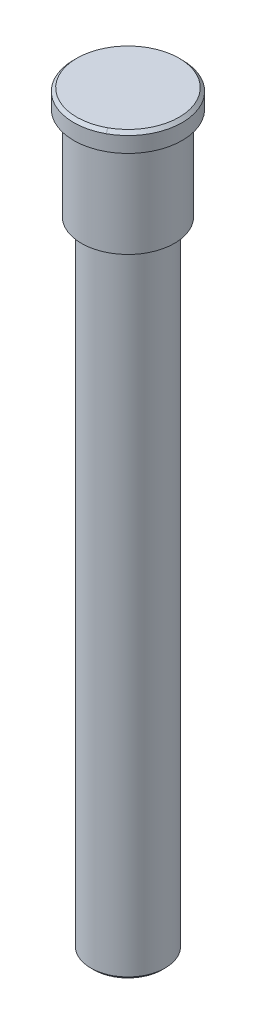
ISO-10303-21;
HEADER;
FILE_DESCRIPTION(('STEP AP214'),'2;1');
FILE_NAME('part.step','',(''),(''),'','','');
FILE_SCHEMA(('AUTOMOTIVE_DESIGN { 1 0 10303 214 1 1 1 1 }'));
ENDSEC;
DATA;
#1=APPLICATION_CONTEXT('core data for automotive mechanical design processes');
#2=APPLICATION_PROTOCOL_DEFINITION('international standard','automotive_design',2000,#1);
#3=PRODUCT_CONTEXT('',#1,'mechanical');
#4=PRODUCT('Part','Part','',(#3));
#5=PRODUCT_RELATED_PRODUCT_CATEGORY('part','',(#4));
#6=PRODUCT_DEFINITION_FORMATION('','',#4);
#7=PRODUCT_DEFINITION_CONTEXT('part definition',#1,'design');
#8=PRODUCT_DEFINITION('design','',#6,#7);
#9=PRODUCT_DEFINITION_SHAPE('','',#8);
#10=(LENGTH_UNIT() NAMED_UNIT(*) SI_UNIT(.MILLI.,.METRE.));
#11=(NAMED_UNIT(*) PLANE_ANGLE_UNIT() SI_UNIT($,.RADIAN.));
#12=(NAMED_UNIT(*) SI_UNIT($,.STERADIAN.) SOLID_ANGLE_UNIT());
#13=UNCERTAINTY_MEASURE_WITH_UNIT(LENGTH_MEASURE(1.E-05),#10,'distance_accuracy_value','');
#14=(GEOMETRIC_REPRESENTATION_CONTEXT(3) GLOBAL_UNCERTAINTY_ASSIGNED_CONTEXT((#13)) GLOBAL_UNIT_ASSIGNED_CONTEXT((#10,
#11,#12)) REPRESENTATION_CONTEXT('',''));
#15=CARTESIAN_POINT('',(0.,0.,0.));
#16=DIRECTION('',(0.,0.,1.));
#17=DIRECTION('',(1.,0.,0.));
#18=AXIS2_PLACEMENT_3D('',#15,#16,#17);
#19=CARTESIAN_POINT('',(0.,0.,0.));
#20=DIRECTION('',(0.,1.,0.));
#21=DIRECTION('',(0.,0.,1.));
#22=AXIS2_PLACEMENT_3D('',#19,#20,#21);
#23=PLANE('',#22);
#24=CARTESIAN_POINT('',(0.,-5.68156632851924E-11,0.));
#25=DIRECTION('',(0.,-1.,0.));
#26=DIRECTION('',(0.,0.,-1.));
#27=AXIS2_PLACEMENT_3D('',#24,#25,#26);
#28=CIRCLE('',#27,16.5000000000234);
#29=CARTESIAN_POINT('',(7.91052138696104,-2.8421709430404E-11,14.4801122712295));
#30=VERTEX_POINT('',#29);
#31=CARTESIAN_POINT('',(-7.91052085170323,-2.8421709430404E-11,-14.4801125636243));
#32=VERTEX_POINT('',#31);
#33=EDGE_CURVE('E28',#30,#32,#28,.T.);
#34=ORIENTED_EDGE('',*,*,#33,.F.);
#35=CARTESIAN_POINT('',(0.,0.,0.));
#36=DIRECTION('',(0.,-1.,0.));
#37=DIRECTION('',(0.,0.,-1.));
#38=AXIS2_PLACEMENT_3D('',#35,#36,#37);
#39=CIRCLE('',#38,16.5000000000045);
#40=EDGE_CURVE('E72',#32,#30,#39,.T.);
#41=ORIENTED_EDGE('',*,*,#40,.F.);
#42=EDGE_LOOP('',(#34,#41));
#43=FACE_BOUND('',#42,.T.);
#44=ADVANCED_FACE('F24',(#43),#23,.T.);
#45=CARTESIAN_POINT('',(0.,-0.999999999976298,0.));
#46=DIRECTION('',(0.,-1.,0.));
#47=DIRECTION('',(0.,0.,-1.));
#48=AXIS2_PLACEMENT_3D('',#45,#46,#47);
#49=CONICAL_SURFACE('',#48,17.4999999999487,0.785398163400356);
#50=DIRECTION('',(-0.339005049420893,0.707106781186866,-0.620544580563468));
#51=VECTOR('',#50,1.);
#52=CARTESIAN_POINT('',(239241.25428467,-499000.000000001,437928.178495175));
#53=LINE('',#52,#51);
#54=CARTESIAN_POINT('',(8.38994692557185,-1.00000000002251,15.3576948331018));
#55=VERTEX_POINT('',#54);
#56=EDGE_CURVE('E70',#30,#55,#53,.F.);
#57=ORIENTED_EDGE('',*,*,#56,.F.);
#58=ORIENTED_EDGE('',*,*,#33,.T.);
#59=CARTESIAN_POINT('',(-8.38994692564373,-1.00000000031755,-15.3576948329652));
#60=CARTESIAN_POINT('',(-8.36997083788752,-0.958333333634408,-15.3211289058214));
#61=CARTESIAN_POINT('',(-8.34999475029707,-0.916666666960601,-15.2845629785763));
#62=CARTESIAN_POINT('',(-8.31004257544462,-0.833333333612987,-15.2114311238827));
#63=CARTESIAN_POINT('',(-8.29006648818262,-0.79166666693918,-15.1748651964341));
#64=CARTESIAN_POINT('',(-8.25011431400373,-0.70833333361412,-15.1017333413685));
#65=CARTESIAN_POINT('',(-8.23013822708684,-0.666666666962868,-15.0651674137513));
#66=CARTESIAN_POINT('',(-8.19018605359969,-0.583333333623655,-14.992035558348));
#67=CARTESIAN_POINT('',(-8.17020996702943,-0.541666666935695,-14.9554696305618));
#68=CARTESIAN_POINT('',(-8.13025779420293,-0.45833333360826,-14.88233777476));
#69=CARTESIAN_POINT('',(-8.11028170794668,-0.416666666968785,-14.8457718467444));
#70=CARTESIAN_POINT('',(-8.07032953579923,-0.333333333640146,-14.772639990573));
#71=CARTESIAN_POINT('',(-8.05035344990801,-0.291666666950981,-14.7360740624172));
#72=CARTESIAN_POINT('',(-8.01040127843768,-0.20833333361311,-14.6629422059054));
#73=CARTESIAN_POINT('',(-7.99042519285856,-0.166666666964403,-14.6263762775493));
#74=CARTESIAN_POINT('',(-7.95047302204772,-0.0833333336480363,-14.5532444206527));
#75=CARTESIAN_POINT('',(-7.930496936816,-0.0416666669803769,-14.5166784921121));
#76=CARTESIAN_POINT('',(-7.9105208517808,-2.8434199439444E-10,-14.4801125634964));
#77=B_SPLINE_CURVE_WITH_KNOTS('',3,(#59,#60,#61,#62,#63,#64,#65,#66,#67,#68,#69,#70,#71,#72,#73,
#74,#75,#76),.UNSPECIFIED.,.F.,.F.,(4,2,2,2,2,2,2,2,4),(0.,0.176776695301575,0.353553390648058,
0.53033008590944,0.707106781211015,0.883883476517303,1.06066017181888,1.23743686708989,
1.41421356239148),.UNSPECIFIED.);
#78=CARTESIAN_POINT('',(-8.38994692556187,-1.0000000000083,-15.3576948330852));
#79=VERTEX_POINT('',#78);
#80=EDGE_CURVE('E67',#79,#32,#77,.T.);
#81=ORIENTED_EDGE('',*,*,#80,.F.);
#82=CARTESIAN_POINT('',(0.,-1.,0.));
#83=DIRECTION('',(0.,1.,0.));
#84=DIRECTION('',(0.,0.,1.));
#85=AXIS2_PLACEMENT_3D('',#82,#83,#84);
#86=CIRCLE('',#85,17.5);
#87=EDGE_CURVE('E74',#55,#79,#86,.F.);
#88=ORIENTED_EDGE('',*,*,#87,.F.);
#89=EDGE_LOOP('',(#57,#58,#81,#88));
#90=FACE_BOUND('',#89,.T.);
#91=ADVANCED_FACE('F65',(#90),#49,.T.);
#92=CARTESIAN_POINT('',(0.,-1.00000000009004,0.));
#93=DIRECTION('',(0.,-1.,0.));
#94=DIRECTION('',(0.,0.,-1.));
#95=AXIS2_PLACEMENT_3D('',#92,#93,#94);
#96=CONICAL_SURFACE('',#95,17.5000000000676,0.785398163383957);
#97=ORIENTED_EDGE('',*,*,#80,.T.);
#98=ORIENTED_EDGE('',*,*,#40,.T.);
#99=ORIENTED_EDGE('',*,*,#56,.T.);
#100=CARTESIAN_POINT('',(0.,-1.,0.));
#101=DIRECTION('',(0.,1.,0.));
#102=DIRECTION('',(0.,0.,1.));
#103=AXIS2_PLACEMENT_3D('',#100,#101,#102);
#104=CIRCLE('',#103,17.5);
#105=EDGE_CURVE('E78',#79,#55,#104,.F.);
#106=ORIENTED_EDGE('',*,*,#105,.F.);
#107=EDGE_LOOP('',(#97,#98,#99,#106));
#108=FACE_BOUND('',#107,.T.);
#109=ADVANCED_FACE('F76',(#108),#96,.T.);
#110=CARTESIAN_POINT('',(0.,-120.5,0.));
#111=DIRECTION('',(0.,1.,0.));
#112=DIRECTION('',(0.,0.,1.));
#113=AXIS2_PLACEMENT_3D('',#110,#111,#112);
#114=CYLINDRICAL_SURFACE('',#113,17.5);
#115=CARTESIAN_POINT('',(0.,-6.00000000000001,0.));
#116=DIRECTION('',(0.,1.,0.));
#117=DIRECTION('',(0.,0.,1.));
#118=AXIS2_PLACEMENT_3D('',#115,#116,#117);
#119=CIRCLE('',#118,17.5);
#120=CARTESIAN_POINT('',(0.,-6.00000000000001,17.5));
#121=VERTEX_POINT('',#120);
#122=EDGE_CURVE('E132',#121,#121,#119,.T.);
#123=ORIENTED_EDGE('',*,*,#122,.T.);
#124=EDGE_LOOP('',(#123));
#125=FACE_BOUND('',#124,.T.);
#126=ORIENTED_EDGE('',*,*,#105,.T.);
#127=ORIENTED_EDGE('',*,*,#87,.T.);
#128=EDGE_LOOP('',(#126,#127));
#129=FACE_BOUND('',#128,.T.);
#130=ADVANCED_FACE('F170',(#125,#129),#114,.T.);
#131=CARTESIAN_POINT('',(0.,-6.00000000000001,17.5));
#132=DIRECTION('',(0.,1.,0.));
#133=DIRECTION('',(0.,0.,1.));
#134=AXIS2_PLACEMENT_3D('',#131,#132,#133);
#135=PLANE('',#134);
#136=CARTESIAN_POINT('',(0.,-6.00000000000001,0.));
#137=DIRECTION('',(0.,1.,0.));
#138=DIRECTION('',(0.,0.,1.));
#139=AXIS2_PLACEMENT_3D('',#136,#137,#138);
#140=CIRCLE('',#139,15.);
#141=CARTESIAN_POINT('',(0.,-6.00000000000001,15.));
#142=VERTEX_POINT('',#141);
#143=EDGE_CURVE('E135',#142,#142,#140,.F.);
#144=ORIENTED_EDGE('',*,*,#143,.F.);
#145=EDGE_LOOP('',(#144));
#146=FACE_BOUND('',#145,.T.);
#147=ORIENTED_EDGE('',*,*,#122,.F.);
#148=EDGE_LOOP('',(#147));
#149=FACE_BOUND('',#148,.T.);
#150=ADVANCED_FACE('F165',(#146,#149),#135,.F.);
#151=CARTESIAN_POINT('',(0.,-120.5,0.));
#152=DIRECTION('',(0.,1.,0.));
#153=DIRECTION('',(0.,0.,1.));
#154=AXIS2_PLACEMENT_3D('',#151,#152,#153);
#155=CYLINDRICAL_SURFACE('',#154,15.);
#156=CARTESIAN_POINT('',(0.,-36.,0.));
#157=DIRECTION('',(0.,1.,0.));
#158=DIRECTION('',(0.,0.,1.));
#159=AXIS2_PLACEMENT_3D('',#156,#157,#158);
#160=CIRCLE('',#159,15.);
#161=CARTESIAN_POINT('',(0.,-36.,15.));
#162=VERTEX_POINT('',#161);
#163=EDGE_CURVE('E143',#162,#162,#160,.T.);
#164=ORIENTED_EDGE('',*,*,#163,.T.);
#165=EDGE_LOOP('',(#164));
#166=FACE_BOUND('',#165,.T.);
#167=ORIENTED_EDGE('',*,*,#143,.T.);
#168=EDGE_LOOP('',(#167));
#169=FACE_BOUND('',#168,.T.);
#170=ADVANCED_FACE('F110',(#166,#169),#155,.T.);
#171=CARTESIAN_POINT('',(0.,-240.000000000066,0.));
#172=DIRECTION('',(0.,1.,0.));
#173=DIRECTION('',(0.,0.,1.));
#174=AXIS2_PLACEMENT_3D('',#171,#172,#173);
#175=CONICAL_SURFACE('',#174,11.9999999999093,0.78539816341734);
#176=DIRECTION('',(-0.339005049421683,-0.707106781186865,-0.620544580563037));
#177=VECTOR('',#176,1.);
#178=CARTESIAN_POINT('',(239354.158999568,499000.,438134.849188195));
#179=LINE('',#178,#177);
#180=CARTESIAN_POINT('',(5.27368092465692,-240.999999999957,9.65340818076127));
#181=VERTEX_POINT('',#180);
#182=CARTESIAN_POINT('',(5.75310646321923,-240.00000000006,10.5309907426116));
#183=VERTEX_POINT('',#182);
#184=EDGE_CURVE('E43',#181,#183,#179,.F.);
#185=ORIENTED_EDGE('',*,*,#184,.T.);
#186=CARTESIAN_POINT('',(0.,-240.,0.));
#187=DIRECTION('',(0.,1.,0.));
#188=DIRECTION('',(0.,0.,1.));
#189=AXIS2_PLACEMENT_3D('',#186,#187,#188);
#190=CIRCLE('',#189,12.);
#191=CARTESIAN_POINT('',(-5.75310646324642,-239.99999999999,-10.5309907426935));
#192=VERTEX_POINT('',#191);
#193=EDGE_CURVE('E104',#192,#183,#190,.T.);
#194=ORIENTED_EDGE('',*,*,#193,.F.);
#195=CARTESIAN_POINT('',(-5.75310646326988,-239.999999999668,-10.5309907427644));
#196=CARTESIAN_POINT('',(-5.73313040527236,-240.041666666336,-10.4944247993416));
#197=CARTESIAN_POINT('',(-5.7131543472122,-240.083333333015,-10.4578588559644));
#198=CARTESIAN_POINT('',(-5.67320223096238,-240.166666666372,-10.3847269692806));
#199=CARTESIAN_POINT('',(-5.65322617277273,-240.208333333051,-10.3481610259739));
#200=CARTESIAN_POINT('',(-5.61327405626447,-240.291666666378,-10.2750291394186));
#201=CARTESIAN_POINT('',(-5.59329799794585,-240.333333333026,-10.2384631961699));
#202=CARTESIAN_POINT('',(-5.55334588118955,-240.416666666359,-10.1653313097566));
#203=CARTESIAN_POINT('',(-5.53336982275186,-240.458333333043,-10.1287653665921));
#204=CARTESIAN_POINT('',(-5.49341770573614,-240.541666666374,-10.0556334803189));
#205=CARTESIAN_POINT('',(-5.47344164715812,-240.583333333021,-10.0190675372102));
#206=CARTESIAN_POINT('',(-5.43348952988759,-240.666666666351,-9.94593565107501));
#207=CARTESIAN_POINT('',(-5.41351347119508,-240.708333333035,-9.90936970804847));
#208=CARTESIAN_POINT('',(-5.3735613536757,-240.79166666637,-9.8362378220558));
#209=CARTESIAN_POINT('',(-5.35358529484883,-240.833333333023,-9.79967187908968));
#210=CARTESIAN_POINT('',(-5.31363317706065,-240.916666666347,-9.72653999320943));
#211=CARTESIAN_POINT('',(-5.29365711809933,-240.958333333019,-9.68997405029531));
#212=CARTESIAN_POINT('',(-5.27368105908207,-240.999999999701,-9.65340810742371));
#213=B_SPLINE_CURVE_WITH_KNOTS('',3,(#195,#196,#197,#198,#199,#200,#201,#202,#203,#204,#205,
#206,#207,#208,#209,#210,#211,#212),.UNSPECIFIED.,.F.,.F.,(4,2,2,2,2,2,2,2,4),(0.,
0.176776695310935,0.353553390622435,0.530330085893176,0.707106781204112,0.883883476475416,
1.06066017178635,1.23743686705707,1.41421356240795),.UNSPECIFIED.);
#214=CARTESIAN_POINT('',(-5.27368105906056,-240.999999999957,-9.65340810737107));
#215=VERTEX_POINT('',#214);
#216=EDGE_CURVE('E119',#192,#215,#213,.T.);
#217=ORIENTED_EDGE('',*,*,#216,.T.);
#218=CARTESIAN_POINT('',(0.,-240.999999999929,0.));
#219=DIRECTION('',(0.,1.,0.));
#220=DIRECTION('',(0.,0.,1.));
#221=AXIS2_PLACEMENT_3D('',#218,#219,#220);
#222=CIRCLE('',#221,11.0000000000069);
#223=EDGE_CURVE('E127',#215,#181,#222,.T.);
#224=ORIENTED_EDGE('',*,*,#223,.T.);
#225=EDGE_LOOP('',(#185,#194,#217,#224));
#226=FACE_BOUND('',#225,.T.);
#227=ADVANCED_FACE('F112',(#226),#175,.T.);
#228=CARTESIAN_POINT('',(0.,-241.,12.));
#229=DIRECTION('',(0.,1.,0.));
#230=DIRECTION('',(0.,0.,1.));
#231=AXIS2_PLACEMENT_3D('',#228,#229,#230);
#232=PLANE('',#231);
#233=ORIENTED_EDGE('',*,*,#223,.F.);
#234=CARTESIAN_POINT('',(0.,-240.999999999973,0.));
#235=DIRECTION('',(0.,1.,0.));
#236=DIRECTION('',(-1.,0.,0.));
#237=AXIS2_PLACEMENT_3D('',#234,#235,#236);
#238=CIRCLE('',#237,10.999999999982);
#239=EDGE_CURVE('E146',#181,#215,#238,.T.);
#240=ORIENTED_EDGE('',*,*,#239,.F.);
#241=EDGE_LOOP('',(#233,#240));
#242=FACE_BOUND('',#241,.T.);
#243=ADVANCED_FACE('F159',(#242),#232,.F.);
#244=CARTESIAN_POINT('',(0.,-36.,15.));
#245=DIRECTION('',(0.,1.,0.));
#246=DIRECTION('',(0.,0.,1.));
#247=AXIS2_PLACEMENT_3D('',#244,#245,#246);
#248=PLANE('',#247);
#249=CARTESIAN_POINT('',(0.,-36.,0.));
#250=DIRECTION('',(0.,1.,0.));
#251=DIRECTION('',(0.,0.,1.));
#252=AXIS2_PLACEMENT_3D('',#249,#250,#251);
#253=CIRCLE('',#252,12.);
#254=CARTESIAN_POINT('',(0.,-36.,12.));
#255=VERTEX_POINT('',#254);
#256=EDGE_CURVE('E34',#255,#255,#253,.F.);
#257=ORIENTED_EDGE('',*,*,#256,.F.);
#258=EDGE_LOOP('',(#257));
#259=FACE_BOUND('',#258,.T.);
#260=ORIENTED_EDGE('',*,*,#163,.F.);
#261=EDGE_LOOP('',(#260));
#262=FACE_BOUND('',#261,.T.);
#263=ADVANCED_FACE('F155',(#259,#262),#248,.F.);
#264=CARTESIAN_POINT('',(0.,-240.000000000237,0.));
#265=DIRECTION('',(0.,1.,0.));
#266=DIRECTION('',(-1.,0.,0.));
#267=AXIS2_PLACEMENT_3D('',#264,#265,#266);
#268=CONICAL_SURFACE('',#267,11.9999999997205,0.785398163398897);
#269=ORIENTED_EDGE('',*,*,#216,.F.);
#270=CARTESIAN_POINT('',(0.,-240.,0.));
#271=DIRECTION('',(0.,1.,0.));
#272=DIRECTION('',(0.,0.,1.));
#273=AXIS2_PLACEMENT_3D('',#270,#271,#272);
#274=CIRCLE('',#273,12.);
#275=EDGE_CURVE('E13',#183,#192,#274,.T.);
#276=ORIENTED_EDGE('',*,*,#275,.F.);
#277=ORIENTED_EDGE('',*,*,#184,.F.);
#278=ORIENTED_EDGE('',*,*,#239,.T.);
#279=EDGE_LOOP('',(#269,#276,#277,#278));
#280=FACE_BOUND('',#279,.T.);
#281=ADVANCED_FACE('F158',(#280),#268,.T.);
#282=CARTESIAN_POINT('',(0.,-120.5,0.));
#283=DIRECTION('',(0.,1.,0.));
#284=DIRECTION('',(0.,0.,1.));
#285=AXIS2_PLACEMENT_3D('',#282,#283,#284);
#286=CYLINDRICAL_SURFACE('',#285,12.);
#287=ORIENTED_EDGE('',*,*,#256,.T.);
#288=EDGE_LOOP('',(#287));
#289=FACE_BOUND('',#288,.T.);
#290=ORIENTED_EDGE('',*,*,#275,.T.);
#291=ORIENTED_EDGE('',*,*,#193,.T.);
#292=EDGE_LOOP('',(#290,#291));
#293=FACE_BOUND('',#292,.T.);
#294=ADVANCED_FACE('F26',(#289,#293),#286,.T.);
#295=CLOSED_SHELL('',(#44,#91,#109,#130,#150,#170,#227,#243,#263,#281,#294));
#296=MANIFOLD_SOLID_BREP('B1',#295);
#297=ADVANCED_BREP_SHAPE_REPRESENTATION('',(#18,#296),#14);
#298=SHAPE_DEFINITION_REPRESENTATION(#9,#297);
ENDSEC;
END-ISO-10303-21;
